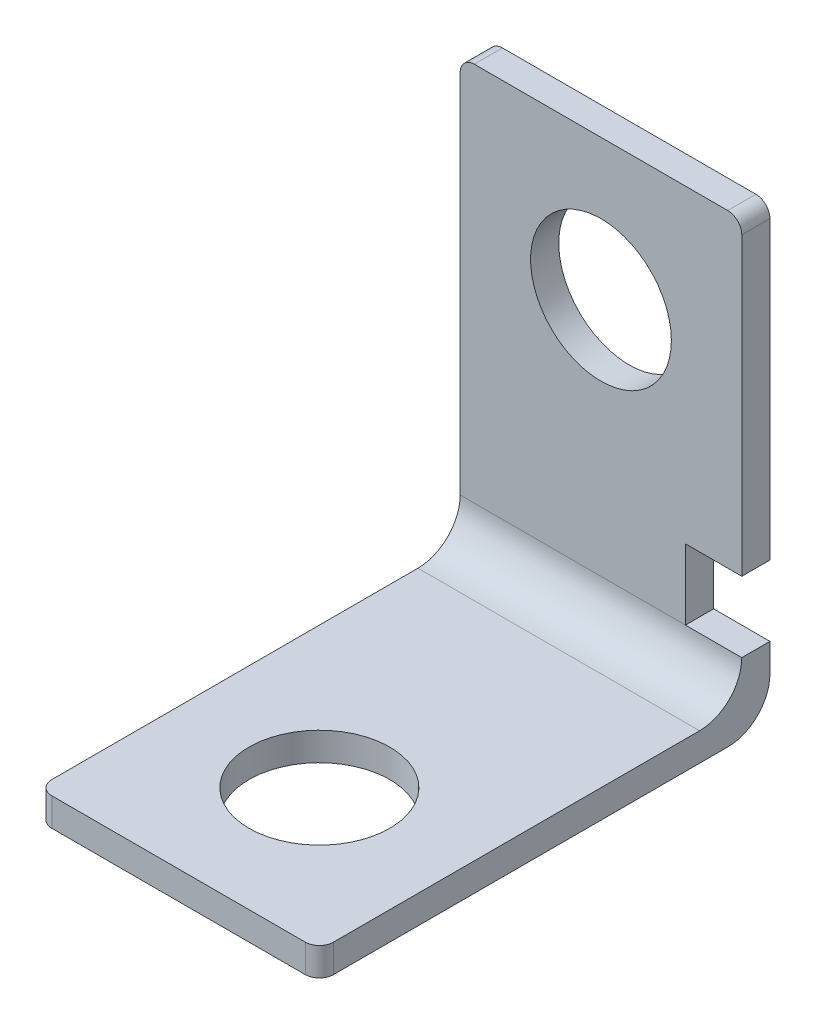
from build123d import *

# Parameters (mm, degrees)
EXTRUDE_THIN1_DEPTH            = 20
F_10_0_10_DIAMETER_HOLE1_D     = 10
F_10_0_10_DIAMETER_HOLE1_DEPTH = 2
F_10_0_10_DIAMETER_HOLE1_TIP   = 3.004303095
FILLET1_R                      = 3
F_10_0_10_DIAMETER_HOLE2_D     = 10
F_10_0_10_DIAMETER_HOLE2_DEPTH = 2
F_10_0_10_DIAMETER_HOLE2_TIP   = 3.004303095
CUT_EXTRUDE1_REACH             = 48.904
SKETCH4_W                      = 4
SKETCH4_H                      = 5
FILLET2_R                      = 1


with BuildPart() as part:
    # Sketch1 → Extrude-Thin1 (new body)
    with BuildSketch(Plane(origin=(0, 0, 0), x_dir=(0, 0, -1), z_dir=(1, 0, 0))):
        Polygon((0, 0), (30, 0), (30, 30), (32, 30), (32, -2), (0, -2), align=None)
    extrude(amount=EXTRUDE_THIN1_DEPTH)

    # 10.0 _10_ Diameter Hole1
    with Locations(Plane(origin=(10, 0, -10), x_dir=(0, 0, 1), z_dir=(0, 1, 0))):
        with Locations((0, 0)):
            Hole(F_10_0_10_DIAMETER_HOLE1_D / 2, depth=F_10_0_10_DIAMETER_HOLE1_DEPTH)
            with Locations((0, 0, -(F_10_0_10_DIAMETER_HOLE1_DEPTH + F_10_0_10_DIAMETER_HOLE1_TIP / 2))):  # 118° drill point
                Cone(0, F_10_0_10_DIAMETER_HOLE1_D / 2, F_10_0_10_DIAMETER_HOLE1_TIP, mode=Mode.SUBTRACT)

    # Fillet1
    fillet1_edges = [part.edges().sort_by_distance(p)[0] for p in [
        (10, -2, -32),
        (10, 0, -30),
    ]]
    fillet(fillet1_edges, radius=FILLET1_R)

    # 10.0 _10_ Diameter Hole2
    with Locations(Plane(origin=(10, 20, -30), x_dir=(1, 0, 0), z_dir=(0, 0, 1))):
        with Locations((0, 0)):
            Hole(F_10_0_10_DIAMETER_HOLE2_D / 2, depth=F_10_0_10_DIAMETER_HOLE2_DEPTH)
            with Locations((0, 0, -(F_10_0_10_DIAMETER_HOLE2_DEPTH + F_10_0_10_DIAMETER_HOLE2_TIP / 2))):  # 118° drill point
                Cone(0, F_10_0_10_DIAMETER_HOLE2_D / 2, F_10_0_10_DIAMETER_HOLE2_TIP, mode=Mode.SUBTRACT)

    # Sketch4 → Cut-Extrude1 (cut, up to next)
    with BuildSketch(Plane.XY.offset(-30), mode=Mode.PRIVATE) as cut_extrude1_sk1:
        with Locations((18, 5.5)):
            Rectangle(SKETCH4_W, SKETCH4_H)
    cut_extrude1_tool1 = extrude(cut_extrude1_sk1.sketch, amount=-CUT_EXTRUDE1_REACH, mode=Mode.PRIVATE) & part.part
    add(cut_extrude1_tool1.solids().sort_by_distance((18, 5.5, -30))[0], mode=Mode.SUBTRACT)

    # Fillet2
    fillet2_edges = [part.edges().sort_by_distance(p)[0] for p in [
        (20, -1, 0),
        (0, -1, 0),
        (0, 30, -31),
        (20, 30, -31),
    ]]
    fillet(fillet2_edges, radius=FILLET2_R)


solid = part.part
